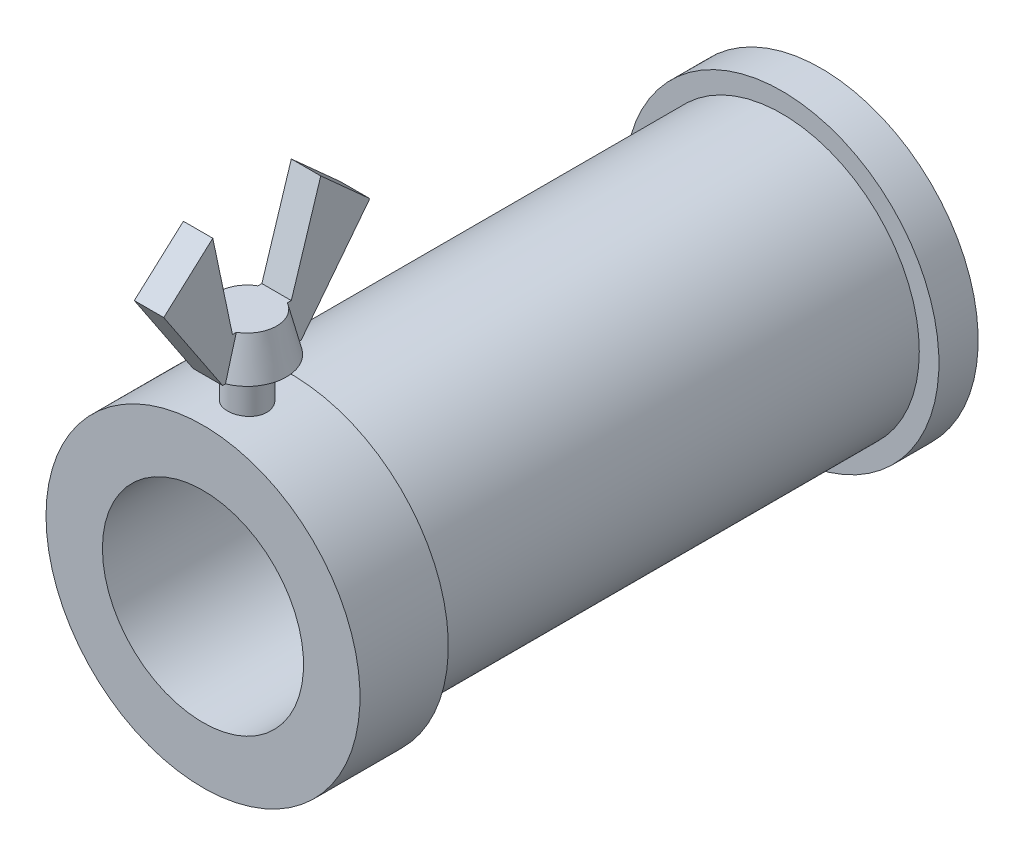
ISO-10303-21;
HEADER;
FILE_DESCRIPTION(('STEP AP214'),'2;1');
FILE_NAME('part.step','',(''),(''),'','','');
FILE_SCHEMA(('AUTOMOTIVE_DESIGN { 1 0 10303 214 1 1 1 1 }'));
ENDSEC;
DATA;
#1=APPLICATION_CONTEXT('core data for automotive mechanical design processes');
#2=APPLICATION_PROTOCOL_DEFINITION('international standard','automotive_design',2000,#1);
#3=PRODUCT_CONTEXT('',#1,'mechanical');
#4=PRODUCT('Part','Part','',(#3));
#5=PRODUCT_RELATED_PRODUCT_CATEGORY('part','',(#4));
#6=PRODUCT_DEFINITION_FORMATION('','',#4);
#7=PRODUCT_DEFINITION_CONTEXT('part definition',#1,'design');
#8=PRODUCT_DEFINITION('design','',#6,#7);
#9=PRODUCT_DEFINITION_SHAPE('','',#8);
#10=(LENGTH_UNIT() NAMED_UNIT(*) SI_UNIT(.MILLI.,.METRE.));
#11=(NAMED_UNIT(*) PLANE_ANGLE_UNIT() SI_UNIT($,.RADIAN.));
#12=(NAMED_UNIT(*) SI_UNIT($,.STERADIAN.) SOLID_ANGLE_UNIT());
#13=UNCERTAINTY_MEASURE_WITH_UNIT(LENGTH_MEASURE(1.E-05),#10,'distance_accuracy_value','');
#14=(GEOMETRIC_REPRESENTATION_CONTEXT(3) GLOBAL_UNCERTAINTY_ASSIGNED_CONTEXT((#13)) GLOBAL_UNIT_ASSIGNED_CONTEXT((#10,
#11,#12)) REPRESENTATION_CONTEXT('',''));
#15=CARTESIAN_POINT('',(0.,0.,0.));
#16=DIRECTION('',(0.,0.,1.));
#17=DIRECTION('',(1.,0.,0.));
#18=AXIS2_PLACEMENT_3D('',#15,#16,#17);
#19=CARTESIAN_POINT('',(0.,24.,58.5));
#20=DIRECTION('',(0.,-1.,0.));
#21=DIRECTION('',(0.,0.,1.));
#22=AXIS2_PLACEMENT_3D('',#19,#20,#21);
#23=CONICAL_SURFACE('',#22,3.,0.244978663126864);
#24=CARTESIAN_POINT('',(-1.5,26.8634565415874,60.2225784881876));
#25=CARTESIAN_POINT('',(-1.5,26.7179564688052,60.2707943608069));
#26=CARTESIAN_POINT('',(-1.5,26.5722086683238,60.3182542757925));
#27=CARTESIAN_POINT('',(-1.5,26.2803109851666,60.4119099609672));
#28=CARTESIAN_POINT('',(-1.5,26.13416111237,60.4581057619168));
#29=CARTESIAN_POINT('',(-1.5,25.8415562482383,60.5494799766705));
#30=CARTESIAN_POINT('',(-1.5,25.6951012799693,60.5946584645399));
#31=CARTESIAN_POINT('',(-1.5,25.4019324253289,60.6841702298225));
#32=CARTESIAN_POINT('',(-1.5,25.2552185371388,60.7285035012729));
#33=CARTESIAN_POINT('',(-1.5,24.8148083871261,60.8604319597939));
#34=CARTESIAN_POINT('',(-1.5,24.5207956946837,60.9469706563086));
#35=CARTESIAN_POINT('',(-1.5,23.9321710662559,61.1179995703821));
#36=CARTESIAN_POINT('',(-1.5,23.6375591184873,61.2024897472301));
#37=CARTESIAN_POINT('',(-1.5,23.1572394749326,61.3388644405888));
#38=CARTESIAN_POINT('',(-1.5,22.9716653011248,61.3912200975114));
#39=CARTESIAN_POINT('',(-1.5,22.6003702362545,61.495403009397));
#40=CARTESIAN_POINT('',(-1.5,22.4146493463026,61.5472302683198));
#41=CARTESIAN_POINT('',(-1.5,21.8572788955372,61.7020403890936));
#42=CARTESIAN_POINT('',(-1.5,21.4854412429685,61.8043460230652));
#43=CARTESIAN_POINT('',(-1.5,20.6318117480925,62.0375328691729));
#44=CARTESIAN_POINT('',(-1.5,20.1498946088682,62.1679546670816));
#45=CARTESIAN_POINT('',(-1.5,19.1856155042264,62.4271461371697));
#46=CARTESIAN_POINT('',(-1.5,18.7032535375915,62.5559158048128));
#47=CARTESIAN_POINT('',(-1.5,17.7382755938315,62.8121964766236));
#48=CARTESIAN_POINT('',(-1.5,17.2556596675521,62.939707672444));
#49=CARTESIAN_POINT('',(-1.5,16.2901756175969,63.1937568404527));
#50=CARTESIAN_POINT('',(-1.5,15.8073074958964,63.3202948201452));
#51=CARTESIAN_POINT('',(-1.5,15.3243477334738,63.4464797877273));
#52=B_SPLINE_CURVE_WITH_KNOTS('',3,(#24,#25,#26,#27,#28,#29,#30,#31,#32,#33,#34,#35,#36,#37,#38,
#39,#40,#41,#42,#43,#44,#45,#46,#47,#48,#49,#50,#51),.UNSPECIFIED.,.F.,.F.,(4,2,2,2,2,2,2,2,2,2,
2,2,2,4),(0.,0.459836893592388,0.919662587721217,1.37945469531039,1.83925004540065,
2.75869016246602,3.6781485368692,4.25660258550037,4.83505229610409,5.99201310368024,
7.48976928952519,8.9875295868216,10.4850581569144,11.982575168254),.UNSPECIFIED.);
#53=CARTESIAN_POINT('',(-1.5,24.,61.0980762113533));
#54=VERTEX_POINT('',#53);
#55=CARTESIAN_POINT('',(-1.5,20.,62.2080992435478));
#56=VERTEX_POINT('',#55);
#57=EDGE_CURVE('E308',#54,#56,#52,.T.);
#58=ORIENTED_EDGE('',*,*,#57,.F.);
#59=CARTESIAN_POINT('',(0.,24.,58.5));
#60=DIRECTION('',(0.,-1.,0.));
#61=DIRECTION('',(0.,0.,1.));
#62=AXIS2_PLACEMENT_3D('',#59,#60,#61);
#63=CIRCLE('',#62,3.);
#64=CARTESIAN_POINT('',(-1.5,24.,55.9019237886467));
#65=VERTEX_POINT('',#64);
#66=EDGE_CURVE('E176',#54,#65,#63,.T.);
#67=ORIENTED_EDGE('',*,*,#66,.T.);
#68=CARTESIAN_POINT('',(-1.5,15.3243477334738,53.5535202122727));
#69=CARTESIAN_POINT('',(-1.5,15.8073880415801,53.6797262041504));
#70=CARTESIAN_POINT('',(-1.5,16.2903366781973,53.8062853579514));
#71=CARTESIAN_POINT('',(-1.5,17.2559717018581,54.0603746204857));
#72=CARTESIAN_POINT('',(-1.5,17.7386580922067,54.1879047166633));
#73=CARTESIAN_POINT('',(-1.5,18.7036262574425,54.4441835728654));
#74=CARTESIAN_POINT('',(-1.5,19.1859080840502,54.5729321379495));
#75=CARTESIAN_POINT('',(-1.5,20.1500361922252,54.8320837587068));
#76=CARTESIAN_POINT('',(-1.5,20.6318824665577,54.962486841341));
#77=CARTESIAN_POINT('',(-1.5,21.5950544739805,55.2255967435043));
#78=CARTESIAN_POINT('',(-1.5,22.0763800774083,55.3583040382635));
#79=CARTESIAN_POINT('',(-1.5,23.038107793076,55.62697047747));
#80=CARTESIAN_POINT('',(-1.5,23.5185099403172,55.7629294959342));
#81=CARTESIAN_POINT('',(-1.5,24.2380729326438,55.9706495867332));
#82=CARTESIAN_POINT('',(-1.5,24.4777770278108,56.0405268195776));
#83=CARTESIAN_POINT('',(-1.5,24.9567027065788,56.1819038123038));
#84=CARTESIAN_POINT('',(-1.5,25.1959242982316,56.2534035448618));
#85=CARTESIAN_POINT('',(-1.5,25.6737573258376,56.398533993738));
#86=CARTESIAN_POINT('',(-1.5,25.9123686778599,56.472164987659));
#87=CARTESIAN_POINT('',(-1.5,26.2696087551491,56.5847837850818));
#88=CARTESIAN_POINT('',(-1.5,26.3885793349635,56.6226865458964));
#89=CARTESIAN_POINT('',(-1.5,26.62624120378,56.699363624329));
#90=CARTESIAN_POINT('',(-1.5,26.7449324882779,56.7381379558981));
#91=CARTESIAN_POINT('',(-1.5,26.8634565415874,56.7774215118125));
#92=B_SPLINE_CURVE_WITH_KNOTS('',3,(#68,#69,#70,#71,#72,#73,#74,#75,#76,#77,#78,#79,#80,#81,#82,
#83,#84,#85,#86,#87,#88,#89,#90,#91),.UNSPECIFIED.,.F.,.F.,(4,2,2,2,2,2,2,2,2,2,2,4),(0.,
1.49776676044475,2.99551418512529,4.4930259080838,5.99056206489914,7.48841083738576,
8.98620167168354,9.73524200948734,10.4842697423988,11.2333954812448,11.6079796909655,
11.9825699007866),.UNSPECIFIED.);
#93=CARTESIAN_POINT('',(-1.5,20.,54.7919007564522));
#94=VERTEX_POINT('',#93);
#95=EDGE_CURVE('E205',#94,#65,#92,.T.);
#96=ORIENTED_EDGE('',*,*,#95,.F.);
#97=CARTESIAN_POINT('',(0.,20.,58.5));
#98=DIRECTION('',(0.,-1.,0.));
#99=DIRECTION('',(0.,0.,1.));
#100=AXIS2_PLACEMENT_3D('',#97,#98,#99);
#101=CIRCLE('',#100,4.);
#102=EDGE_CURVE('E174',#56,#94,#101,.T.);
#103=ORIENTED_EDGE('',*,*,#102,.F.);
#104=EDGE_LOOP('',(#58,#67,#96,#103));
#105=FACE_BOUND('',#104,.T.);
#106=ADVANCED_FACE('F14',(#105),#23,.T.);
#107=CARTESIAN_POINT('',(-16.,0.,0.));
#108=DIRECTION('',(0.,0.,1.));
#109=DIRECTION('',(1.,0.,0.));
#110=AXIS2_PLACEMENT_3D('',#107,#108,#109);
#111=PLANE('',#110);
#112=CARTESIAN_POINT('',(0.,0.,0.));
#113=DIRECTION('',(0.,0.,-1.));
#114=DIRECTION('',(-1.,0.,0.));
#115=AXIS2_PLACEMENT_3D('',#112,#113,#114);
#116=CIRCLE('',#115,10.25);
#117=CARTESIAN_POINT('',(-10.25,0.,0.));
#118=VERTEX_POINT('',#117);
#119=EDGE_CURVE('E181',#118,#118,#116,.T.);
#120=ORIENTED_EDGE('',*,*,#119,.F.);
#121=EDGE_LOOP('',(#120));
#122=FACE_BOUND('',#121,.T.);
#123=CARTESIAN_POINT('',(0.,0.,0.));
#124=DIRECTION('',(0.,0.,-1.));
#125=DIRECTION('',(-1.,0.,0.));
#126=AXIS2_PLACEMENT_3D('',#123,#124,#125);
#127=CIRCLE('',#126,16.);
#128=CARTESIAN_POINT('',(-16.,0.,0.));
#129=VERTEX_POINT('',#128);
#130=EDGE_CURVE('E202',#129,#129,#127,.T.);
#131=ORIENTED_EDGE('',*,*,#130,.T.);
#132=EDGE_LOOP('',(#131));
#133=FACE_BOUND('',#132,.T.);
#134=ADVANCED_FACE('F16',(#122,#133),#111,.F.);
#135=CARTESIAN_POINT('',(0.,0.,3.));
#136=DIRECTION('',(0.,0.,-1.));
#137=DIRECTION('',(-1.,0.,0.));
#138=AXIS2_PLACEMENT_3D('',#135,#136,#137);
#139=CYLINDRICAL_SURFACE('',#138,16.);
#140=ORIENTED_EDGE('',*,*,#130,.F.);
#141=EDGE_LOOP('',(#140));
#142=FACE_BOUND('',#141,.T.);
#143=CARTESIAN_POINT('',(0.,0.,4.));
#144=DIRECTION('',(0.,0.,-1.));
#145=DIRECTION('',(-1.,0.,0.));
#146=AXIS2_PLACEMENT_3D('',#143,#144,#145);
#147=CIRCLE('',#146,16.);
#148=CARTESIAN_POINT('',(-16.,0.,4.));
#149=VERTEX_POINT('',#148);
#150=EDGE_CURVE('E199',#149,#149,#147,.T.);
#151=ORIENTED_EDGE('',*,*,#150,.T.);
#152=EDGE_LOOP('',(#151));
#153=FACE_BOUND('',#152,.T.);
#154=ADVANCED_FACE('F254',(#142,#153),#139,.T.);
#155=CARTESIAN_POINT('',(-14.,0.,4.));
#156=DIRECTION('',(0.,0.,-1.));
#157=DIRECTION('',(-1.,0.,0.));
#158=AXIS2_PLACEMENT_3D('',#155,#156,#157);
#159=PLANE('',#158);
#160=ORIENTED_EDGE('',*,*,#150,.F.);
#161=EDGE_LOOP('',(#160));
#162=FACE_BOUND('',#161,.T.);
#163=CARTESIAN_POINT('',(0.,0.,4.));
#164=DIRECTION('',(0.,0.,-1.));
#165=DIRECTION('',(-1.,0.,0.));
#166=AXIS2_PLACEMENT_3D('',#163,#164,#165);
#167=CIRCLE('',#166,14.);
#168=CARTESIAN_POINT('',(-14.,0.,4.));
#169=VERTEX_POINT('',#168);
#170=EDGE_CURVE('E196',#169,#169,#167,.T.);
#171=ORIENTED_EDGE('',*,*,#170,.T.);
#172=EDGE_LOOP('',(#171));
#173=FACE_BOUND('',#172,.T.);
#174=ADVANCED_FACE('F434',(#162,#173),#159,.F.);
#175=CARTESIAN_POINT('',(0.,0.,3.));
#176=DIRECTION('',(0.,0.,-1.));
#177=DIRECTION('',(-1.,0.,0.));
#178=AXIS2_PLACEMENT_3D('',#175,#176,#177);
#179=CYLINDRICAL_SURFACE('',#178,14.);
#180=ORIENTED_EDGE('',*,*,#170,.F.);
#181=EDGE_LOOP('',(#180));
#182=FACE_BOUND('',#181,.T.);
#183=CARTESIAN_POINT('',(0.,0.,54.));
#184=DIRECTION('',(0.,0.,-1.));
#185=DIRECTION('',(-1.,0.,0.));
#186=AXIS2_PLACEMENT_3D('',#183,#184,#185);
#187=CIRCLE('',#186,14.);
#188=CARTESIAN_POINT('',(-14.,0.,54.));
#189=VERTEX_POINT('',#188);
#190=EDGE_CURVE('E193',#189,#189,#187,.T.);
#191=ORIENTED_EDGE('',*,*,#190,.T.);
#192=EDGE_LOOP('',(#191));
#193=FACE_BOUND('',#192,.T.);
#194=ADVANCED_FACE('F425',(#182,#193),#179,.T.);
#195=CARTESIAN_POINT('',(-16.,0.,54.));
#196=DIRECTION('',(0.,0.,1.));
#197=DIRECTION('',(1.,0.,0.));
#198=AXIS2_PLACEMENT_3D('',#195,#196,#197);
#199=PLANE('',#198);
#200=ORIENTED_EDGE('',*,*,#190,.F.);
#201=EDGE_LOOP('',(#200));
#202=FACE_BOUND('',#201,.T.);
#203=CARTESIAN_POINT('',(0.,0.,54.));
#204=DIRECTION('',(0.,0.,-1.));
#205=DIRECTION('',(-1.,0.,0.));
#206=AXIS2_PLACEMENT_3D('',#203,#204,#205);
#207=CIRCLE('',#206,16.);
#208=CARTESIAN_POINT('',(-16.,0.,54.));
#209=VERTEX_POINT('',#208);
#210=EDGE_CURVE('E190',#209,#209,#207,.T.);
#211=ORIENTED_EDGE('',*,*,#210,.T.);
#212=EDGE_LOOP('',(#211));
#213=FACE_BOUND('',#212,.T.);
#214=ADVANCED_FACE('F244',(#202,#213),#199,.F.);
#215=CARTESIAN_POINT('',(0.,0.,3.));
#216=DIRECTION('',(0.,0.,-1.));
#217=DIRECTION('',(-1.,0.,0.));
#218=AXIS2_PLACEMENT_3D('',#215,#216,#217);
#219=CYLINDRICAL_SURFACE('',#218,16.);
#220=CARTESIAN_POINT('',(0.,16.,60.5));
#221=CARTESIAN_POINT('',(-0.111872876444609,15.9999984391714,60.4999952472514));
#222=CARTESIAN_POINT('',(-0.223815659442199,15.9988142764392,60.4905816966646));
#223=CARTESIAN_POINT('',(-0.444586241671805,15.9942043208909,60.4531777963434));
#224=CARTESIAN_POINT('',(-0.553410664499,15.9907761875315,60.4251680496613));
#225=CARTESIAN_POINT('',(-0.764716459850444,15.9820644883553,60.3514098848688));
#226=CARTESIAN_POINT('',(-0.867202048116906,15.9767821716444,60.3056734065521));
#227=CARTESIAN_POINT('',(-1.06302357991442,15.9649496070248,60.1977861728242));
#228=CARTESIAN_POINT('',(-1.15636108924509,15.9583995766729,60.1356382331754));
#229=CARTESIAN_POINT('',(-1.33177025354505,15.9447225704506,59.9963264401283));
#230=CARTESIAN_POINT('',(-1.4137842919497,15.9375929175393,59.919090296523));
#231=CARTESIAN_POINT('',(-1.563722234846,15.923581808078,59.7519497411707));
#232=CARTESIAN_POINT('',(-1.63164542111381,15.9167003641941,59.6620446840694));
#233=CARTESIAN_POINT('',(-1.75168812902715,15.9039384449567,59.4717440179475));
#234=CARTESIAN_POINT('',(-1.80375367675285,15.8980614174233,59.3713141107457));
#235=CARTESIAN_POINT('',(-1.89025846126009,15.8880090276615,59.1630503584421));
#236=CARTESIAN_POINT('',(-1.92469836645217,15.8838336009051,59.0552167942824));
#237=CARTESIAN_POINT('',(-1.97479918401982,15.8776827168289,58.8358046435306));
#238=CARTESIAN_POINT('',(-1.99055737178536,15.875695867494,58.7242485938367));
#239=CARTESIAN_POINT('',(-2.00314843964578,15.8741122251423,58.5000589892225));
#240=CARTESIAN_POINT('',(-1.99998208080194,15.8745153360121,58.387425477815));
#241=CARTESIAN_POINT('',(-1.97489378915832,15.877655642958,58.164956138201));
#242=CARTESIAN_POINT('',(-1.95307901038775,15.8803795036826,58.0551080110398));
#243=CARTESIAN_POINT('',(-1.89148030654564,15.887833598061,57.8406439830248));
#244=CARTESIAN_POINT('',(-1.85169601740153,15.8925638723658,57.7360281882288));
#245=CARTESIAN_POINT('',(-1.75517244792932,15.9035129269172,57.5346656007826));
#246=CARTESIAN_POINT('',(-1.6983866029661,15.9097357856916,57.4379413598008));
#247=CARTESIAN_POINT('',(-1.56950517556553,15.9229656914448,57.2553546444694));
#248=CARTESIAN_POINT('',(-1.49740889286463,15.9299727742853,57.169492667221));
#249=CARTESIAN_POINT('',(-1.33935928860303,15.9440408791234,57.0104458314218));
#250=CARTESIAN_POINT('',(-1.25331360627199,15.9511019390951,56.9373527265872));
#251=CARTESIAN_POINT('',(-1.07012573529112,15.9644370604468,56.8066328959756));
#252=CARTESIAN_POINT('',(-0.9729835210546,15.9707111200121,56.7490062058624));
#253=CARTESIAN_POINT('',(-0.770289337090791,15.9817692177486,56.6508549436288));
#254=CARTESIAN_POINT('',(-0.664734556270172,15.9865527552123,56.610336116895));
#255=CARTESIAN_POINT('',(-0.448246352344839,15.9940862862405,56.5476236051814));
#256=CARTESIAN_POINT('',(-0.337313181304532,15.996836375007,56.5254290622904));
#257=CARTESIAN_POINT('',(-0.1140105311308,15.9999807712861,56.5001140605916));
#258=CARTESIAN_POINT('',(-0.00165559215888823,16.0003906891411,56.4968672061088));
#259=CARTESIAN_POINT('',(0.221996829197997,15.9988507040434,56.5092061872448));
#260=CARTESIAN_POINT('',(0.333294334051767,15.9969008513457,56.5247916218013));
#261=CARTESIAN_POINT('',(0.551299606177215,15.9908701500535,56.5742477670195));
#262=CARTESIAN_POINT('',(0.658021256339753,15.9867963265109,56.6080582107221));
#263=CARTESIAN_POINT('',(0.864279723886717,15.9769737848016,56.6929419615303));
#264=CARTESIAN_POINT('',(0.963816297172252,15.971225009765,56.7440158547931));
#265=CARTESIAN_POINT('',(1.15344361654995,15.9586545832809,56.8622825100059));
#266=CARTESIAN_POINT('',(1.24348300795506,15.9518275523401,56.9295570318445));
#267=CARTESIAN_POINT('',(1.41103759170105,15.9378811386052,57.0781995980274));
#268=CARTESIAN_POINT('',(1.48855228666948,15.9307617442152,57.1595682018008));
#269=CARTESIAN_POINT('',(1.62930556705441,15.9169848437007,57.3346459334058));
#270=CARTESIAN_POINT('',(1.69246036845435,15.9103301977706,57.4284226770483));
#271=CARTESIAN_POINT('',(1.80212231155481,15.8982832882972,57.6253265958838));
#272=CARTESIAN_POINT('',(1.8486297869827,15.8928909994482,57.7284535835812));
#273=CARTESIAN_POINT('',(1.92354126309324,15.883998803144,57.9408602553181));
#274=CARTESIAN_POINT('',(1.95199250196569,15.8804939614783,58.0501230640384));
#275=CARTESIAN_POINT('',(1.99013599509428,15.8757593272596,58.2719219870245));
#276=CARTESIAN_POINT('',(1.99982912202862,15.8745294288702,58.3844579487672));
#277=CARTESIAN_POINT('',(2.00016522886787,15.8744870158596,58.6087751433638));
#278=CARTESIAN_POINT('',(1.99093983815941,15.8756577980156,58.7205561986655));
#279=CARTESIAN_POINT('',(1.95397952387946,15.8802489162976,58.9409657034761));
#280=CARTESIAN_POINT('',(1.92624459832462,15.8836692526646,59.0495941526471));
#281=CARTESIAN_POINT('',(1.85309365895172,15.8923689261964,59.2605975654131));
#282=CARTESIAN_POINT('',(1.80768398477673,15.8976475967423,59.3629747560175));
#283=CARTESIAN_POINT('',(1.70048552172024,15.9094702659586,59.5586773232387));
#284=CARTESIAN_POINT('',(1.63869652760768,15.9160142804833,59.6520025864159));
#285=CARTESIAN_POINT('',(1.50000506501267,15.9296848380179,59.8276249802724));
#286=CARTESIAN_POINT('',(1.42300450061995,15.9368149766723,59.909844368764));
#287=CARTESIAN_POINT('',(1.25628018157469,15.9508226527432,60.0602454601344));
#288=CARTESIAN_POINT('',(1.16655343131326,15.9577001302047,60.1284238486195));
#289=CARTESIAN_POINT('',(0.976532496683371,15.970456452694,60.2490282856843));
#290=CARTESIAN_POINT('',(0.876199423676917,15.9763314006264,60.3013934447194));
#291=CARTESIAN_POINT('',(0.668146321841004,15.9863811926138,60.388456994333));
#292=CARTESIAN_POINT('',(0.560434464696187,15.9905578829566,60.4231745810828));
#293=CARTESIAN_POINT('',(0.376804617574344,15.995733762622,60.4656474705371));
#294=CARTESIAN_POINT('',(0.302044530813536,15.9973258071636,60.4785111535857));
#295=CARTESIAN_POINT('',(0.151533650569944,15.9994594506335,60.4956889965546));
#296=CARTESIAN_POINT('',(0.0757828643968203,16.0000010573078,60.5000032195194));
#297=CARTESIAN_POINT('',(0.,16.,60.5));
#298=B_SPLINE_CURVE_WITH_KNOTS('',3,(#220,#221,#222,#223,#224,#225,#226,#227,#228,#229,#230,
#231,#232,#233,#234,#235,#236,#237,#238,#239,#240,#241,#242,#243,#244,#245,#246,#247,#248,#249,
#250,#251,#252,#253,#254,#255,#256,#257,#258,#259,#260,#261,#262,#263,#264,#265,#266,#267,#268,
#269,#270,#271,#272,#273,#274,#275,#276,#277,#278,#279,#280,#281,#282,#283,#284,#285,#286,#287,
#288,#289,#290,#291,#292,#293,#294,#295,#296,#297),.UNSPECIFIED.,.T.,.F.,(4,2,2,2,2,2,2,2,2,2,2,
2,2,2,2,2,2,2,2,2,2,2,2,2,2,2,2,2,2,2,2,2,2,2,2,2,2,2,4),(0.,0.335341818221,0.671033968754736,
1.00650040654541,1.3419093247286,1.67896650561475,2.01604086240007,2.35425000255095,
2.69244631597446,3.02887380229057,3.36528775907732,3.69978157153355,4.03428216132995,
4.36970741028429,4.70514800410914,5.04290782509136,5.38066842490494,5.71854236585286,
6.05640048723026,6.39200223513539,6.72759683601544,7.06208843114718,7.39659138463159,
7.7328192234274,8.06906041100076,8.40721577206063,8.74536435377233,9.08262459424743,
9.41986914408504,9.75477520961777,10.0896813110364,10.424467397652,10.7592576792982,
11.0962819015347,11.4333855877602,11.7717712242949,12.1097879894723,12.3369507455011,
12.5641118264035),.UNSPECIFIED.);
#299=CARTESIAN_POINT('',(0.,16.,60.5));
#300=VERTEX_POINT('',#299);
#301=EDGE_CURVE('E180',#300,#300,#298,.T.);
#302=ORIENTED_EDGE('',*,*,#301,.T.);
#303=EDGE_LOOP('',(#302));
#304=FACE_BOUND('',#303,.T.);
#305=ORIENTED_EDGE('',*,*,#210,.F.);
#306=EDGE_LOOP('',(#305));
#307=FACE_BOUND('',#306,.T.);
#308=CARTESIAN_POINT('',(0.,0.,63.));
#309=DIRECTION('',(0.,0.,-1.));
#310=DIRECTION('',(-1.,0.,0.));
#311=AXIS2_PLACEMENT_3D('',#308,#309,#310);
#312=CIRCLE('',#311,16.);
#313=CARTESIAN_POINT('',(-16.,0.,63.));
#314=VERTEX_POINT('',#313);
#315=EDGE_CURVE('E187',#314,#314,#312,.T.);
#316=ORIENTED_EDGE('',*,*,#315,.T.);
#317=EDGE_LOOP('',(#316));
#318=FACE_BOUND('',#317,.T.);
#319=ADVANCED_FACE('F219',(#304,#307,#318),#219,.T.);
#320=CARTESIAN_POINT('',(-10.25,0.,63.));
#321=DIRECTION('',(0.,0.,-1.));
#322=DIRECTION('',(-1.,0.,0.));
#323=AXIS2_PLACEMENT_3D('',#320,#321,#322);
#324=PLANE('',#323);
#325=ORIENTED_EDGE('',*,*,#315,.F.);
#326=EDGE_LOOP('',(#325));
#327=FACE_BOUND('',#326,.T.);
#328=CARTESIAN_POINT('',(0.,0.,63.));
#329=DIRECTION('',(0.,0.,-1.));
#330=DIRECTION('',(-1.,0.,0.));
#331=AXIS2_PLACEMENT_3D('',#328,#329,#330);
#332=CIRCLE('',#331,10.25);
#333=CARTESIAN_POINT('',(-10.25,0.,63.));
#334=VERTEX_POINT('',#333);
#335=EDGE_CURVE('E184',#334,#334,#332,.T.);
#336=ORIENTED_EDGE('',*,*,#335,.T.);
#337=EDGE_LOOP('',(#336));
#338=FACE_BOUND('',#337,.T.);
#339=ADVANCED_FACE('F236',(#327,#338),#324,.F.);
#340=CARTESIAN_POINT('',(0.,0.,3.));
#341=DIRECTION('',(0.,0.,-1.));
#342=DIRECTION('',(-1.,0.,0.));
#343=AXIS2_PLACEMENT_3D('',#340,#341,#342);
#344=CYLINDRICAL_SURFACE('',#343,10.25);
#345=ORIENTED_EDGE('',*,*,#335,.F.);
#346=EDGE_LOOP('',(#345));
#347=FACE_BOUND('',#346,.T.);
#348=ORIENTED_EDGE('',*,*,#119,.T.);
#349=EDGE_LOOP('',(#348));
#350=FACE_BOUND('',#349,.T.);
#351=ADVANCED_FACE('F229',(#347,#350),#344,.F.);
#352=CARTESIAN_POINT('',(0.,-40.,58.5));
#353=DIRECTION('',(0.,-1.,0.));
#354=DIRECTION('',(0.,0.,1.));
#355=AXIS2_PLACEMENT_3D('',#352,#353,#354);
#356=CYLINDRICAL_SURFACE('',#355,2.);
#357=CARTESIAN_POINT('',(0.,20.,58.5));
#358=DIRECTION('',(0.,-1.,0.));
#359=DIRECTION('',(0.,0.,1.));
#360=AXIS2_PLACEMENT_3D('',#357,#358,#359);
#361=CIRCLE('',#360,2.);
#362=CARTESIAN_POINT('',(0.,20.,60.5));
#363=VERTEX_POINT('',#362);
#364=EDGE_CURVE('E177',#363,#363,#361,.T.);
#365=ORIENTED_EDGE('',*,*,#364,.T.);
#366=EDGE_LOOP('',(#365));
#367=FACE_BOUND('',#366,.T.);
#368=ORIENTED_EDGE('',*,*,#301,.F.);
#369=EDGE_LOOP('',(#368));
#370=FACE_BOUND('',#369,.T.);
#371=ADVANCED_FACE('F223',(#367,#370),#356,.T.);
#372=CARTESIAN_POINT('',(0.,20.,54.5));
#373=DIRECTION('',(0.,1.,0.));
#374=DIRECTION('',(0.,0.,-1.));
#375=AXIS2_PLACEMENT_3D('',#372,#373,#374);
#376=PLANE('',#375);
#377=ORIENTED_EDGE('',*,*,#364,.F.);
#378=EDGE_LOOP('',(#377));
#379=FACE_BOUND('',#378,.T.);
#380=CARTESIAN_POINT('',(1.5,20.,54.7919007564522));
#381=VERTEX_POINT('',#380);
#382=CARTESIAN_POINT('',(1.5,20.,62.2080992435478));
#383=VERTEX_POINT('',#382);
#384=EDGE_CURVE('E116',#381,#383,#101,.T.);
#385=ORIENTED_EDGE('',*,*,#384,.T.);
#386=DIRECTION('',(0.,0.,1.));
#387=VECTOR('',#386,1.);
#388=CARTESIAN_POINT('',(1.5,20.,54.5));
#389=LINE('',#388,#387);
#390=CARTESIAN_POINT('',(1.5,20.,62.5));
#391=VERTEX_POINT('',#390);
#392=EDGE_CURVE('E132',#383,#391,#389,.T.);
#393=ORIENTED_EDGE('',*,*,#392,.T.);
#394=DIRECTION('',(1.,0.,0.));
#395=VECTOR('',#394,1.);
#396=CARTESIAN_POINT('',(-1.5,20.,62.5));
#397=LINE('',#396,#395);
#398=CARTESIAN_POINT('',(-1.5,20.,62.5));
#399=VERTEX_POINT('',#398);
#400=EDGE_CURVE('E167',#399,#391,#397,.T.);
#401=ORIENTED_EDGE('',*,*,#400,.F.);
#402=DIRECTION('',(0.,0.,1.));
#403=VECTOR('',#402,1.);
#404=CARTESIAN_POINT('',(-1.5,20.,54.5));
#405=LINE('',#404,#403);
#406=EDGE_CURVE('E152',#56,#399,#405,.T.);
#407=ORIENTED_EDGE('',*,*,#406,.F.);
#408=ORIENTED_EDGE('',*,*,#102,.T.);
#409=CARTESIAN_POINT('',(-1.5,20.,54.5));
#410=VERTEX_POINT('',#409);
#411=EDGE_CURVE('E149',#410,#94,#405,.T.);
#412=ORIENTED_EDGE('',*,*,#411,.F.);
#413=DIRECTION('',(1.,0.,0.));
#414=VECTOR('',#413,1.);
#415=CARTESIAN_POINT('',(-1.5,20.,54.5));
#416=LINE('',#415,#414);
#417=CARTESIAN_POINT('',(1.5,20.,54.5));
#418=VERTEX_POINT('',#417);
#419=EDGE_CURVE('E169',#410,#418,#416,.T.);
#420=ORIENTED_EDGE('',*,*,#419,.T.);
#421=EDGE_CURVE('E283',#418,#381,#389,.T.);
#422=ORIENTED_EDGE('',*,*,#421,.T.);
#423=EDGE_LOOP('',(#385,#393,#401,#407,#408,#412,#420,#422));
#424=FACE_BOUND('',#423,.T.);
#425=ADVANCED_FACE('F228',(#379,#424),#376,.F.);
#426=CARTESIAN_POINT('',(0.,24.,55.5));
#427=DIRECTION('',(0.,1.,0.));
#428=DIRECTION('',(0.,0.,-1.));
#429=AXIS2_PLACEMENT_3D('',#426,#427,#428);
#430=PLANE('',#429);
#431=CARTESIAN_POINT('',(1.5,24.,55.9019237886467));
#432=VERTEX_POINT('',#431);
#433=CARTESIAN_POINT('',(1.5,24.,61.0980762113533));
#434=VERTEX_POINT('',#433);
#435=EDGE_CURVE('E34',#432,#434,#63,.T.);
#436=ORIENTED_EDGE('',*,*,#435,.F.);
#437=DIRECTION('',(0.,0.,1.));
#438=VECTOR('',#437,1.);
#439=CARTESIAN_POINT('',(1.5,24.,55.5));
#440=LINE('',#439,#438);
#441=CARTESIAN_POINT('',(1.5,24.,55.5));
#442=VERTEX_POINT('',#441);
#443=EDGE_CURVE('E159',#442,#432,#440,.T.);
#444=ORIENTED_EDGE('',*,*,#443,.F.);
#445=DIRECTION('',(1.,0.,0.));
#446=VECTOR('',#445,1.);
#447=CARTESIAN_POINT('',(-1.5,24.,55.5));
#448=LINE('',#447,#446);
#449=CARTESIAN_POINT('',(-1.5,24.,55.5));
#450=VERTEX_POINT('',#449);
#451=EDGE_CURVE('E122',#450,#442,#448,.T.);
#452=ORIENTED_EDGE('',*,*,#451,.F.);
#453=DIRECTION('',(0.,0.,1.));
#454=VECTOR('',#453,1.);
#455=CARTESIAN_POINT('',(-1.5,24.,55.5));
#456=LINE('',#455,#454);
#457=EDGE_CURVE('E136',#450,#65,#456,.T.);
#458=ORIENTED_EDGE('',*,*,#457,.T.);
#459=ORIENTED_EDGE('',*,*,#66,.F.);
#460=CARTESIAN_POINT('',(-1.5,24.,61.5));
#461=VERTEX_POINT('',#460);
#462=EDGE_CURVE('E139',#54,#461,#456,.T.);
#463=ORIENTED_EDGE('',*,*,#462,.T.);
#464=DIRECTION('',(1.,0.,0.));
#465=VECTOR('',#464,1.);
#466=CARTESIAN_POINT('',(-1.5,24.,61.5));
#467=LINE('',#466,#465);
#468=CARTESIAN_POINT('',(1.5,24.,61.5));
#469=VERTEX_POINT('',#468);
#470=EDGE_CURVE('E161',#461,#469,#467,.T.);
#471=ORIENTED_EDGE('',*,*,#470,.T.);
#472=EDGE_CURVE('E271',#434,#469,#440,.T.);
#473=ORIENTED_EDGE('',*,*,#472,.F.);
#474=EDGE_LOOP('',(#436,#444,#452,#458,#459,#463,#471,#473));
#475=FACE_BOUND('',#474,.T.);
#476=ADVANCED_FACE('F231',(#475),#430,.T.);
#477=ORIENTED_EDGE('',*,*,#435,.T.);
#478=CARTESIAN_POINT('',(1.5,26.8634565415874,60.2225784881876));
#479=CARTESIAN_POINT('',(1.5,26.7179564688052,60.2707943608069));
#480=CARTESIAN_POINT('',(1.5,26.5722086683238,60.3182542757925));
#481=CARTESIAN_POINT('',(1.5,26.2803109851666,60.4119099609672));
#482=CARTESIAN_POINT('',(1.5,26.13416111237,60.4581057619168));
#483=CARTESIAN_POINT('',(1.5,25.8415562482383,60.5494799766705));
#484=CARTESIAN_POINT('',(1.5,25.6951012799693,60.5946584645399));
#485=CARTESIAN_POINT('',(1.5,25.4019324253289,60.6841702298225));
#486=CARTESIAN_POINT('',(1.5,25.2552185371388,60.7285035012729));
#487=CARTESIAN_POINT('',(1.5,24.8148083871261,60.8604319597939));
#488=CARTESIAN_POINT('',(1.5,24.5207956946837,60.9469706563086));
#489=CARTESIAN_POINT('',(1.5,23.9321710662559,61.1179995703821));
#490=CARTESIAN_POINT('',(1.5,23.6375591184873,61.2024897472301));
#491=CARTESIAN_POINT('',(1.5,23.1572394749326,61.3388644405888));
#492=CARTESIAN_POINT('',(1.5,22.9716653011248,61.3912200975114));
#493=CARTESIAN_POINT('',(1.5,22.6003702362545,61.495403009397));
#494=CARTESIAN_POINT('',(1.5,22.4146493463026,61.5472302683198));
#495=CARTESIAN_POINT('',(1.5,21.8572788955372,61.7020403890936));
#496=CARTESIAN_POINT('',(1.5,21.4854412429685,61.8043460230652));
#497=CARTESIAN_POINT('',(1.5,20.6318117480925,62.0375328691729));
#498=CARTESIAN_POINT('',(1.5,20.1498946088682,62.1679546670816));
#499=CARTESIAN_POINT('',(1.5,19.1856155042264,62.4271461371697));
#500=CARTESIAN_POINT('',(1.5,18.7032535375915,62.5559158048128));
#501=CARTESIAN_POINT('',(1.5,17.7382755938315,62.8121964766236));
#502=CARTESIAN_POINT('',(1.5,17.2556596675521,62.939707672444));
#503=CARTESIAN_POINT('',(1.5,16.2901756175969,63.1937568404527));
#504=CARTESIAN_POINT('',(1.5,15.8073074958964,63.3202948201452));
#505=CARTESIAN_POINT('',(1.5,15.3243477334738,63.4464797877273));
#506=B_SPLINE_CURVE_WITH_KNOTS('',3,(#478,#479,#480,#481,#482,#483,#484,#485,#486,#487,#488,
#489,#490,#491,#492,#493,#494,#495,#496,#497,#498,#499,#500,#501,#502,#503,#504,#505),
.UNSPECIFIED.,.F.,.F.,(4,2,2,2,2,2,2,2,2,2,2,2,2,4),(0.,0.459836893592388,0.919662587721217,
1.37945469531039,1.83925004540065,2.75869016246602,3.6781485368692,4.25660258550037,
4.83505229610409,5.99201310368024,7.48976928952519,8.9875295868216,10.4850581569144,
11.982575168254),.UNSPECIFIED.);
#507=EDGE_CURVE('E9',#434,#383,#506,.T.);
#508=ORIENTED_EDGE('',*,*,#507,.T.);
#509=ORIENTED_EDGE('',*,*,#384,.F.);
#510=CARTESIAN_POINT('',(1.5,15.3243477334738,53.5535202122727));
#511=CARTESIAN_POINT('',(1.5,15.8073880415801,53.6797262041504));
#512=CARTESIAN_POINT('',(1.5,16.2903366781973,53.8062853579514));
#513=CARTESIAN_POINT('',(1.5,17.2559717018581,54.0603746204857));
#514=CARTESIAN_POINT('',(1.5,17.7386580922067,54.1879047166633));
#515=CARTESIAN_POINT('',(1.5,18.7036262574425,54.4441835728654));
#516=CARTESIAN_POINT('',(1.5,19.1859080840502,54.5729321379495));
#517=CARTESIAN_POINT('',(1.5,20.1500361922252,54.8320837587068));
#518=CARTESIAN_POINT('',(1.5,20.6318824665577,54.962486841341));
#519=CARTESIAN_POINT('',(1.5,21.5950544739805,55.2255967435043));
#520=CARTESIAN_POINT('',(1.5,22.0763800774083,55.3583040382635));
#521=CARTESIAN_POINT('',(1.5,23.038107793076,55.62697047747));
#522=CARTESIAN_POINT('',(1.5,23.5185099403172,55.7629294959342));
#523=CARTESIAN_POINT('',(1.5,24.2380729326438,55.9706495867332));
#524=CARTESIAN_POINT('',(1.5,24.4777770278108,56.0405268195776));
#525=CARTESIAN_POINT('',(1.5,24.9567027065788,56.1819038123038));
#526=CARTESIAN_POINT('',(1.5,25.1959242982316,56.2534035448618));
#527=CARTESIAN_POINT('',(1.5,25.6737573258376,56.398533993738));
#528=CARTESIAN_POINT('',(1.5,25.9123686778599,56.472164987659));
#529=CARTESIAN_POINT('',(1.5,26.2696087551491,56.5847837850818));
#530=CARTESIAN_POINT('',(1.5,26.3885793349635,56.6226865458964));
#531=CARTESIAN_POINT('',(1.5,26.62624120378,56.699363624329));
#532=CARTESIAN_POINT('',(1.5,26.7449324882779,56.7381379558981));
#533=CARTESIAN_POINT('',(1.5,26.8634565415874,56.7774215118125));
#534=B_SPLINE_CURVE_WITH_KNOTS('',3,(#510,#511,#512,#513,#514,#515,#516,#517,#518,#519,#520,
#521,#522,#523,#524,#525,#526,#527,#528,#529,#530,#531,#532,#533),.UNSPECIFIED.,.F.,.F.,(4,2,2,
2,2,2,2,2,2,2,2,4),(0.,1.49776676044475,2.99551418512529,4.4930259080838,5.99056206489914,
7.48841083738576,8.98620167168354,9.73524200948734,10.4842697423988,11.2333954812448,
11.6079796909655,11.9825699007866),.UNSPECIFIED.);
#535=EDGE_CURVE('E28',#381,#432,#534,.T.);
#536=ORIENTED_EDGE('',*,*,#535,.T.);
#537=EDGE_LOOP('',(#477,#508,#509,#536));
#538=FACE_BOUND('',#537,.T.);
#539=ADVANCED_FACE('F250',(#538),#23,.T.);
#540=CARTESIAN_POINT('',(-1.5,20.,54.5));
#541=DIRECTION('',(0.,-0.61394061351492,-0.789352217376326));
#542=DIRECTION('',(0.,-0.789352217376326,0.61394061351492));
#543=AXIS2_PLACEMENT_3D('',#540,#541,#542);
#544=PLANE('',#543);
#545=ORIENTED_EDGE('',*,*,#419,.F.);
#546=DIRECTION('',(0.,0.789352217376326,-0.61394061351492));
#547=VECTOR('',#546,1.);
#548=CARTESIAN_POINT('',(-1.5,20.,54.5));
#549=LINE('',#548,#547);
#550=CARTESIAN_POINT('',(-1.5,29.,47.5));
#551=VERTEX_POINT('',#550);
#552=EDGE_CURVE('E153',#410,#551,#549,.T.);
#553=ORIENTED_EDGE('',*,*,#552,.T.);
#554=DIRECTION('',(1.,0.,0.));
#555=VECTOR('',#554,1.);
#556=CARTESIAN_POINT('',(-1.5,29.,47.5));
#557=LINE('',#556,#555);
#558=CARTESIAN_POINT('',(1.5,29.,47.5));
#559=VERTEX_POINT('',#558);
#560=EDGE_CURVE('E117',#551,#559,#557,.T.);
#561=ORIENTED_EDGE('',*,*,#560,.T.);
#562=DIRECTION('',(0.,0.789352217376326,-0.61394061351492));
#563=VECTOR('',#562,1.);
#564=CARTESIAN_POINT('',(1.5,20.,54.5));
#565=LINE('',#564,#563);
#566=EDGE_CURVE('E130',#418,#559,#565,.T.);
#567=ORIENTED_EDGE('',*,*,#566,.F.);
#568=EDGE_LOOP('',(#545,#553,#561,#567));
#569=FACE_BOUND('',#568,.T.);
#570=ADVANCED_FACE('F259',(#569),#544,.T.);
#571=CARTESIAN_POINT('',(-1.5,29.,47.5));
#572=DIRECTION('',(0.,0.743294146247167,-0.668964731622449));
#573=DIRECTION('',(0.,-0.668964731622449,-0.743294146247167));
#574=AXIS2_PLACEMENT_3D('',#571,#572,#573);
#575=PLANE('',#574);
#576=ORIENTED_EDGE('',*,*,#560,.F.);
#577=DIRECTION('',(0.,0.668964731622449,0.743294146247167));
#578=VECTOR('',#577,1.);
#579=CARTESIAN_POINT('',(-1.5,29.,47.5));
#580=LINE('',#579,#578);
#581=CARTESIAN_POINT('',(-1.5,33.5,52.5));
#582=VERTEX_POINT('',#581);
#583=EDGE_CURVE('E112',#551,#582,#580,.T.);
#584=ORIENTED_EDGE('',*,*,#583,.T.);
#585=DIRECTION('',(1.,0.,0.));
#586=VECTOR('',#585,1.);
#587=CARTESIAN_POINT('',(-1.5,33.5,52.5));
#588=LINE('',#587,#586);
#589=CARTESIAN_POINT('',(1.5,33.5,52.5));
#590=VERTEX_POINT('',#589);
#591=EDGE_CURVE('E105',#582,#590,#588,.T.);
#592=ORIENTED_EDGE('',*,*,#591,.T.);
#593=DIRECTION('',(0.,0.668964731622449,0.743294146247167));
#594=VECTOR('',#593,1.);
#595=CARTESIAN_POINT('',(1.5,29.,47.5));
#596=LINE('',#595,#594);
#597=EDGE_CURVE('E109',#559,#590,#596,.T.);
#598=ORIENTED_EDGE('',*,*,#597,.F.);
#599=EDGE_LOOP('',(#576,#584,#592,#598));
#600=FACE_BOUND('',#599,.T.);
#601=ADVANCED_FACE('F107',(#600),#575,.T.);
#602=CARTESIAN_POINT('',(1.5,20.,56.7631578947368));
#603=DIRECTION('',(1.,0.,0.));
#604=DIRECTION('',(0.,0.,-1.));
#605=AXIS2_PLACEMENT_3D('',#602,#603,#604);
#606=PLANE('',#605);
#607=ORIENTED_EDGE('',*,*,#535,.F.);
#608=ORIENTED_EDGE('',*,*,#421,.F.);
#609=ORIENTED_EDGE('',*,*,#566,.T.);
#610=ORIENTED_EDGE('',*,*,#597,.T.);
#611=DIRECTION('',(0.,0.953582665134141,-0.301131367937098));
#612=VECTOR('',#611,1.);
#613=CARTESIAN_POINT('',(1.5,24.,55.5));
#614=LINE('',#613,#612);
#615=EDGE_CURVE('E120',#442,#590,#614,.T.);
#616=ORIENTED_EDGE('',*,*,#615,.F.);
#617=ORIENTED_EDGE('',*,*,#443,.T.);
#618=EDGE_LOOP('',(#607,#608,#609,#610,#616,#617));
#619=FACE_BOUND('',#618,.T.);
#620=ADVANCED_FACE('F127',(#619),#606,.T.);
#621=CARTESIAN_POINT('',(-1.5,24.,55.5));
#622=DIRECTION('',(0.,-0.301131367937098,-0.953582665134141));
#623=DIRECTION('',(0.,-0.953582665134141,0.301131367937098));
#624=AXIS2_PLACEMENT_3D('',#621,#622,#623);
#625=PLANE('',#624);
#626=ORIENTED_EDGE('',*,*,#591,.F.);
#627=DIRECTION('',(0.,0.953582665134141,-0.301131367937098));
#628=VECTOR('',#627,1.);
#629=CARTESIAN_POINT('',(-1.5,24.,55.5));
#630=LINE('',#629,#628);
#631=EDGE_CURVE('E157',#450,#582,#630,.T.);
#632=ORIENTED_EDGE('',*,*,#631,.F.);
#633=ORIENTED_EDGE('',*,*,#451,.T.);
#634=ORIENTED_EDGE('',*,*,#615,.T.);
#635=EDGE_LOOP('',(#626,#632,#633,#634));
#636=FACE_BOUND('',#635,.T.);
#637=ADVANCED_FACE('F121',(#636),#625,.F.);
#638=CARTESIAN_POINT('',(-1.5,20.,56.7631578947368));
#639=DIRECTION('',(1.,0.,0.));
#640=DIRECTION('',(0.,0.,-1.));
#641=AXIS2_PLACEMENT_3D('',#638,#639,#640);
#642=PLANE('',#641);
#643=ORIENTED_EDGE('',*,*,#411,.T.);
#644=ORIENTED_EDGE('',*,*,#95,.T.);
#645=ORIENTED_EDGE('',*,*,#457,.F.);
#646=ORIENTED_EDGE('',*,*,#631,.T.);
#647=ORIENTED_EDGE('',*,*,#583,.F.);
#648=ORIENTED_EDGE('',*,*,#552,.F.);
#649=EDGE_LOOP('',(#643,#644,#645,#646,#647,#648));
#650=FACE_BOUND('',#649,.T.);
#651=ADVANCED_FACE('F314',(#650),#642,.F.);
#652=ORIENTED_EDGE('',*,*,#507,.F.);
#653=ORIENTED_EDGE('',*,*,#472,.T.);
#654=DIRECTION('',(0.,0.978549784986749,0.206010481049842));
#655=VECTOR('',#654,1.);
#656=CARTESIAN_POINT('',(1.5,24.,61.5));
#657=LINE('',#656,#655);
#658=CARTESIAN_POINT('',(1.5,33.5,63.5));
#659=VERTEX_POINT('',#658);
#660=EDGE_CURVE('E274',#469,#659,#657,.T.);
#661=ORIENTED_EDGE('',*,*,#660,.T.);
#662=DIRECTION('',(0.,-0.668964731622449,0.743294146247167));
#663=VECTOR('',#662,1.);
#664=CARTESIAN_POINT('',(1.5,33.5,63.5));
#665=LINE('',#664,#663);
#666=CARTESIAN_POINT('',(1.5,29.,68.5));
#667=VERTEX_POINT('',#666);
#668=EDGE_CURVE('E278',#659,#667,#665,.T.);
#669=ORIENTED_EDGE('',*,*,#668,.T.);
#670=DIRECTION('',(0.,0.832050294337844,0.554700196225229));
#671=VECTOR('',#670,1.);
#672=CARTESIAN_POINT('',(1.5,20.,62.5));
#673=LINE('',#672,#671);
#674=EDGE_CURVE('E281',#391,#667,#673,.T.);
#675=ORIENTED_EDGE('',*,*,#674,.F.);
#676=ORIENTED_EDGE('',*,*,#392,.F.);
#677=EDGE_LOOP('',(#652,#653,#661,#669,#675,#676));
#678=FACE_BOUND('',#677,.T.);
#679=ADVANCED_FACE('F292',(#678),#606,.T.);
#680=ORIENTED_EDGE('',*,*,#462,.F.);
#681=ORIENTED_EDGE('',*,*,#57,.T.);
#682=ORIENTED_EDGE('',*,*,#406,.T.);
#683=DIRECTION('',(0.,0.832050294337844,0.554700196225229));
#684=VECTOR('',#683,1.);
#685=CARTESIAN_POINT('',(-1.5,20.,62.5));
#686=LINE('',#685,#684);
#687=CARTESIAN_POINT('',(-1.5,29.,68.5));
#688=VERTEX_POINT('',#687);
#689=EDGE_CURVE('E146',#399,#688,#686,.T.);
#690=ORIENTED_EDGE('',*,*,#689,.T.);
#691=DIRECTION('',(0.,-0.668964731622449,0.743294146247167));
#692=VECTOR('',#691,1.);
#693=CARTESIAN_POINT('',(-1.5,33.5,63.5));
#694=LINE('',#693,#692);
#695=CARTESIAN_POINT('',(-1.5,33.5,63.5));
#696=VERTEX_POINT('',#695);
#697=EDGE_CURVE('E143',#696,#688,#694,.T.);
#698=ORIENTED_EDGE('',*,*,#697,.F.);
#699=DIRECTION('',(0.,0.978549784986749,0.206010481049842));
#700=VECTOR('',#699,1.);
#701=CARTESIAN_POINT('',(-1.5,24.,61.5));
#702=LINE('',#701,#700);
#703=EDGE_CURVE('E140',#461,#696,#702,.T.);
#704=ORIENTED_EDGE('',*,*,#703,.F.);
#705=EDGE_LOOP('',(#680,#681,#682,#690,#698,#704));
#706=FACE_BOUND('',#705,.T.);
#707=ADVANCED_FACE('F299',(#706),#642,.F.);
#708=CARTESIAN_POINT('',(-1.5,20.,62.5));
#709=DIRECTION('',(0.,0.554700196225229,-0.832050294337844));
#710=DIRECTION('',(0.,-0.832050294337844,-0.554700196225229));
#711=AXIS2_PLACEMENT_3D('',#708,#709,#710);
#712=PLANE('',#711);
#713=DIRECTION('',(1.,0.,0.));
#714=VECTOR('',#713,1.);
#715=CARTESIAN_POINT('',(-1.5,29.,68.5));
#716=LINE('',#715,#714);
#717=EDGE_CURVE('E165',#688,#667,#716,.T.);
#718=ORIENTED_EDGE('',*,*,#717,.F.);
#719=ORIENTED_EDGE('',*,*,#689,.F.);
#720=ORIENTED_EDGE('',*,*,#400,.T.);
#721=ORIENTED_EDGE('',*,*,#674,.T.);
#722=EDGE_LOOP('',(#718,#719,#720,#721));
#723=FACE_BOUND('',#722,.T.);
#724=ADVANCED_FACE('F295',(#723),#712,.F.);
#725=CARTESIAN_POINT('',(-1.5,33.5,63.5));
#726=DIRECTION('',(0.,0.743294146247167,0.668964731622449));
#727=DIRECTION('',(0.,0.668964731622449,-0.743294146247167));
#728=AXIS2_PLACEMENT_3D('',#725,#726,#727);
#729=PLANE('',#728);
#730=DIRECTION('',(1.,0.,0.));
#731=VECTOR('',#730,1.);
#732=CARTESIAN_POINT('',(-1.5,33.5,63.5));
#733=LINE('',#732,#731);
#734=EDGE_CURVE('E163',#696,#659,#733,.T.);
#735=ORIENTED_EDGE('',*,*,#734,.F.);
#736=ORIENTED_EDGE('',*,*,#697,.T.);
#737=ORIENTED_EDGE('',*,*,#717,.T.);
#738=ORIENTED_EDGE('',*,*,#668,.F.);
#739=EDGE_LOOP('',(#735,#736,#737,#738));
#740=FACE_BOUND('',#739,.T.);
#741=ADVANCED_FACE('F303',(#740),#729,.T.);
#742=CARTESIAN_POINT('',(-1.5,24.,61.5));
#743=DIRECTION('',(0.,0.206010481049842,-0.978549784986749));
#744=DIRECTION('',(0.,-0.978549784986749,-0.206010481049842));
#745=AXIS2_PLACEMENT_3D('',#742,#743,#744);
#746=PLANE('',#745);
#747=ORIENTED_EDGE('',*,*,#470,.F.);
#748=ORIENTED_EDGE('',*,*,#703,.T.);
#749=ORIENTED_EDGE('',*,*,#734,.T.);
#750=ORIENTED_EDGE('',*,*,#660,.F.);
#751=EDGE_LOOP('',(#747,#748,#749,#750));
#752=FACE_BOUND('',#751,.T.);
#753=ADVANCED_FACE('F307',(#752),#746,.T.);
#754=CLOSED_SHELL('',(#106,#134,#154,#174,#194,#214,#319,#339,#351,#371,#425,#476,#539,#570,
#601,#620,#637,#651,#679,#707,#724,#741,#753));
#755=MANIFOLD_SOLID_BREP('B1',#754);
#756=ADVANCED_BREP_SHAPE_REPRESENTATION('',(#18,#755),#14);
#757=SHAPE_DEFINITION_REPRESENTATION(#9,#756);
ENDSEC;
END-ISO-10303-21;
